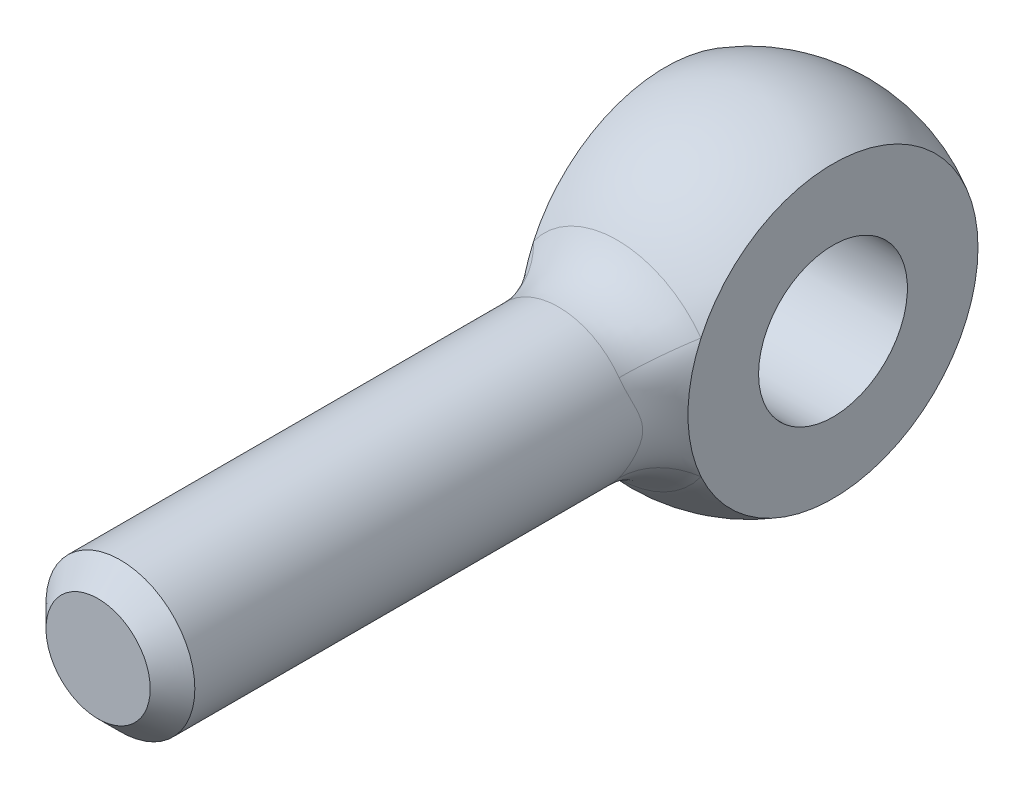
ISO-10303-21;
HEADER;
FILE_DESCRIPTION(('STEP AP214'),'2;1');
FILE_NAME('part.step','',(''),(''),'','','');
FILE_SCHEMA(('AUTOMOTIVE_DESIGN { 1 0 10303 214 1 1 1 1 }'));
ENDSEC;
DATA;
#1=APPLICATION_CONTEXT('core data for automotive mechanical design processes');
#2=APPLICATION_PROTOCOL_DEFINITION('international standard','automotive_design',2000,#1);
#3=PRODUCT_CONTEXT('',#1,'mechanical');
#4=PRODUCT('Part','Part','',(#3));
#5=PRODUCT_RELATED_PRODUCT_CATEGORY('part','',(#4));
#6=PRODUCT_DEFINITION_FORMATION('','',#4);
#7=PRODUCT_DEFINITION_CONTEXT('part definition',#1,'design');
#8=PRODUCT_DEFINITION('design','',#6,#7);
#9=PRODUCT_DEFINITION_SHAPE('','',#8);
#10=(LENGTH_UNIT() NAMED_UNIT(*) SI_UNIT(.MILLI.,.METRE.));
#11=(NAMED_UNIT(*) PLANE_ANGLE_UNIT() SI_UNIT($,.RADIAN.));
#12=(NAMED_UNIT(*) SI_UNIT($,.STERADIAN.) SOLID_ANGLE_UNIT());
#13=UNCERTAINTY_MEASURE_WITH_UNIT(LENGTH_MEASURE(1.E-05),#10,'distance_accuracy_value','');
#14=(GEOMETRIC_REPRESENTATION_CONTEXT(3) GLOBAL_UNCERTAINTY_ASSIGNED_CONTEXT((#13)) GLOBAL_UNIT_ASSIGNED_CONTEXT((#10,
#11,#12)) REPRESENTATION_CONTEXT('',''));
#15=CARTESIAN_POINT('',(0.,0.,0.));
#16=DIRECTION('',(0.,0.,1.));
#17=DIRECTION('',(1.,0.,0.));
#18=AXIS2_PLACEMENT_3D('',#15,#16,#17);
#19=CARTESIAN_POINT('',(0.,0.,0.));
#20=DIRECTION('',(-1.,0.,0.));
#21=DIRECTION('',(0.,0.,-1.));
#22=AXIS2_PLACEMENT_3D('',#19,#20,#21);
#23=SPHERICAL_SURFACE('',#22,9.);
#24=CARTESIAN_POINT('',(4.5,0.,0.));
#25=DIRECTION('',(1.,0.,0.));
#26=DIRECTION('',(0.,0.,1.));
#27=AXIS2_PLACEMENT_3D('',#24,#25,#26);
#28=CIRCLE('',#27,7.79422863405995);
#29=CARTESIAN_POINT('',(4.5,3.22870813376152,7.09404283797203));
#30=VERTEX_POINT('',#29);
#31=CARTESIAN_POINT('',(4.5,-3.22870813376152,7.09404283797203));
#32=VERTEX_POINT('',#31);
#33=EDGE_CURVE('E64',#30,#32,#28,.F.);
#34=ORIENTED_EDGE('',*,*,#33,.T.);
#35=CARTESIAN_POINT('',(0.,0.,7.09404283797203));
#36=DIRECTION('',(0.,0.,-1.));
#37=DIRECTION('',(-1.,0.,0.));
#38=AXIS2_PLACEMENT_3D('',#35,#36,#37);
#39=CIRCLE('',#38,5.53846153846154);
#40=CARTESIAN_POINT('',(-4.5,-3.22870813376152,7.09404283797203));
#41=VERTEX_POINT('',#40);
#42=EDGE_CURVE('E72',#32,#41,#39,.T.);
#43=ORIENTED_EDGE('',*,*,#42,.T.);
#44=CARTESIAN_POINT('',(-4.5,0.,0.));
#45=DIRECTION('',(1.,0.,0.));
#46=DIRECTION('',(0.,0.,1.));
#47=AXIS2_PLACEMENT_3D('',#44,#45,#46);
#48=CIRCLE('',#47,7.79422863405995);
#49=CARTESIAN_POINT('',(-4.5,3.22870813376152,7.09404283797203));
#50=VERTEX_POINT('',#49);
#51=EDGE_CURVE('E60',#50,#41,#48,.F.);
#52=ORIENTED_EDGE('',*,*,#51,.F.);
#53=CARTESIAN_POINT('',(0.,0.,7.09404283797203));
#54=DIRECTION('',(0.,0.,-1.));
#55=DIRECTION('',(-1.,0.,0.));
#56=AXIS2_PLACEMENT_3D('',#53,#54,#55);
#57=CIRCLE('',#56,5.53846153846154);
#58=EDGE_CURVE('E69',#50,#30,#57,.T.);
#59=ORIENTED_EDGE('',*,*,#58,.T.);
#60=EDGE_LOOP('',(#34,#43,#52,#59));
#61=FACE_BOUND('',#60,.T.);
#62=ADVANCED_FACE('F14',(#61),#23,.T.);
#63=CARTESIAN_POINT('',(0.,0.,-10.));
#64=DIRECTION('',(0.,0.,-1.));
#65=DIRECTION('',(1.,0.,0.));
#66=AXIS2_PLACEMENT_3D('',#63,#64,#65);
#67=CYLINDRICAL_SURFACE('',#66,4.);
#68=CARTESIAN_POINT('',(4.5,3.8544457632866,6.77445553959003));
#69=CARTESIAN_POINT('',(3.04270474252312,2.62315350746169,7.93032272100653));
#70=CARTESIAN_POINT('',(2.7741231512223,2.881707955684,10.1296027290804));
#71=CARTESIAN_POINT('',(4.5,3.8063552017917,6.8018140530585));
#72=CARTESIAN_POINT('',(3.05482576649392,2.60369447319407,7.96461619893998));
#73=CARTESIAN_POINT('',(2.81753121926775,2.83992613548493,10.1500330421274));
#74=CARTESIAN_POINT('',(4.5,3.75734620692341,6.82902432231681));
#75=CARTESIAN_POINT('',(3.06839168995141,2.5833163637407,7.99813664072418));
#76=CARTESIAN_POINT('',(2.86015231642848,2.79700081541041,10.1676065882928));
#77=CARTESIAN_POINT('',(4.5,3.65731222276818,6.88311775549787));
#78=CARTESIAN_POINT('',(3.09821295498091,2.54027572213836,8.06327876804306));
#79=CARTESIAN_POINT('',(2.94360667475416,2.70903056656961,10.1973192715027));
#80=CARTESIAN_POINT('',(4.5,3.60628811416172,6.91000105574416));
#81=CARTESIAN_POINT('',(3.11445034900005,2.51763114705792,8.09489992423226));
#82=CARTESIAN_POINT('',(2.98444070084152,2.66398656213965,10.2094607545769));
#83=CARTESIAN_POINT('',(4.5,3.45034294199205,6.98990310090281));
#84=CARTESIAN_POINT('',(3.16665597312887,2.44590984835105,8.18616546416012));
#85=CARTESIAN_POINT('',(3.10362883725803,2.5262969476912,10.2380896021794));
#86=CARTESIAN_POINT('',(4.5,3.34210856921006,7.04242695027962));
#87=CARTESIAN_POINT('',(3.20638316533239,2.39264902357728,8.24298064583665));
#88=CARTESIAN_POINT('',(3.17907335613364,2.43070509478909,10.2469645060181));
#89=CARTESIAN_POINT('',(4.5,3.07131788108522,7.16568134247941));
#90=CARTESIAN_POINT('',(3.30980222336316,2.24847718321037,8.36667989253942));
#91=CARTESIAN_POINT('',(3.3484402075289,2.19463495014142,10.2469316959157));
#92=CARTESIAN_POINT('',(4.5,2.90397618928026,7.23557083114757));
#93=CARTESIAN_POINT('',(3.37687085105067,2.15099293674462,8.42942404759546));
#94=CARTESIAN_POINT('',(3.4381775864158,2.05112903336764,10.2297903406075));
#95=CARTESIAN_POINT('',(4.5,2.63520895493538,7.33585873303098));
#96=CARTESIAN_POINT('',(3.48042901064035,1.97974794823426,8.50775356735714));
#97=CARTESIAN_POINT('',(3.55838650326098,1.82895031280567,10.1852430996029));
#98=CARTESIAN_POINT('',(4.5,2.54243406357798,7.36859815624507));
#99=CARTESIAN_POINT('',(3.51533532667,1.9187130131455,8.53118988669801));
#100=CARTESIAN_POINT('',(3.5961245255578,1.75356165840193,10.1671934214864));
#101=CARTESIAN_POINT('',(4.5,2.35049327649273,7.43205257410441));
#102=CARTESIAN_POINT('',(3.58449538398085,1.7884352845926,8.57274310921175));
#103=CARTESIAN_POINT('',(3.66666176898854,1.60082878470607,10.1262456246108));
#104=CARTESIAN_POINT('',(4.5,2.25132856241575,7.46276794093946));
#105=CARTESIAN_POINT('',(3.61876374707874,1.71923098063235,8.59090327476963));
#106=CARTESIAN_POINT('',(3.69946189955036,1.52348492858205,10.1033484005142));
#107=CARTESIAN_POINT('',(4.5,2.0304613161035,7.52611271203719));
#108=CARTESIAN_POINT('',(3.69027444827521,1.56151844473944,8.62452070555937));
#109=CARTESIAN_POINT('',(3.76469519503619,1.35514764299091,10.0506349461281));
#110=CARTESIAN_POINT('',(4.5,1.90763213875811,7.55831566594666));
#111=CARTESIAN_POINT('',(3.72725176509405,1.47161056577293,8.63921494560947));
#112=CARTESIAN_POINT('',(3.79630400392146,1.26387674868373,10.020296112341));
#113=CARTESIAN_POINT('',(4.5,1.65232180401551,7.61820329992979));
#114=CARTESIAN_POINT('',(3.79632113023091,1.28138713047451,8.66269061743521));
#115=CARTESIAN_POINT('',(3.85283376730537,1.07934568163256,9.95859137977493));
#116=CARTESIAN_POINT('',(4.5,1.51983775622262,7.64588661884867));
#117=CARTESIAN_POINT('',(3.82847639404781,1.18104454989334,8.67151974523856));
#118=CARTESIAN_POINT('',(3.87775270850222,0.986084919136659,9.92722517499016));
#119=CARTESIAN_POINT('',(4.5,1.24584793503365,7.69526663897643));
#120=CARTESIAN_POINT('',(3.88574227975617,0.971416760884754,8.68456342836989));
#121=CARTESIAN_POINT('',(3.92072690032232,0.798212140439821,9.86763071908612));
#122=CARTESIAN_POINT('',(4.5,1.1043877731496,7.71699102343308));
#123=CARTESIAN_POINT('',(3.91095703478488,0.862096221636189,8.68883167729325));
#124=CARTESIAN_POINT('',(3.93881404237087,0.703608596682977,9.83938833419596));
#125=CARTESIAN_POINT('',(4.5,0.812986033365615,7.75309875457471));
#126=CARTESIAN_POINT('',(3.95269307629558,0.635873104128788,8.69452000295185));
#127=CARTESIAN_POINT('',(3.96815692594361,0.51286586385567,9.79055451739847));
#128=CARTESIAN_POINT('',(4.5,0.663048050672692,7.76748518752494));
#129=CARTESIAN_POINT('',(3.96928412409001,0.518825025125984,8.69595666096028));
#130=CARTESIAN_POINT('',(3.97941553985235,0.416727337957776,9.76995986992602));
#131=CARTESIAN_POINT('',(4.5,0.365918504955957,7.78697722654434));
#132=CARTESIAN_POINT('',(3.99168629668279,0.286607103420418,8.69758027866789));
#133=CARTESIAN_POINT('',(3.99451236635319,0.22864233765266,9.74161988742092));
#134=CARTESIAN_POINT('',(4.5,0.219018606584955,7.79254362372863));
#135=CARTESIAN_POINT('',(3.99806921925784,0.171508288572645,8.69783425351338));
#136=CARTESIAN_POINT('',(3.99871971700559,0.13675110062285,9.73323857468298));
#137=CARTESIAN_POINT('',(4.5,-0.0755179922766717,7.79525312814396));
#138=CARTESIAN_POINT('',(4.00117364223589,-0.059112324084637,8.69798034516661));
#139=CARTESIAN_POINT('',(4.00077867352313,-0.0471659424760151,9.72918999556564));
#140=CARTESIAN_POINT('',(4.5,-0.223154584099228,7.79239744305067));
#141=CARTESIAN_POINT('',(3.99790203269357,-0.174838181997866,8.69787274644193));
#142=CARTESIAN_POINT('',(3.99863119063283,-0.139191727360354,9.73352090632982));
#143=CARTESIAN_POINT('',(4.5,-0.515398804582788,7.7785543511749));
#144=CARTESIAN_POINT('',(3.98201549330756,-0.403449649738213,8.69691703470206));
#145=CARTESIAN_POINT('',(3.98800822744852,-0.322967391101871,9.75391826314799));
#146=CARTESIAN_POINT('',(4.5,-0.659988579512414,7.76752813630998));
#147=CARTESIAN_POINT('',(3.9693285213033,-0.516511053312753,8.69606346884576));
#148=CARTESIAN_POINT('',(3.9795025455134,-0.414713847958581,9.77004071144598));
#149=CARTESIAN_POINT('',(4.5,-0.942285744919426,7.73836484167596));
#150=CARTESIAN_POINT('',(3.93569076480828,-0.736344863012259,8.69237263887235));
#151=CARTESIAN_POINT('',(3.95627218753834,-0.596957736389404,9.81071532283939));
#152=CARTESIAN_POINT('',(4.5,-1.07998941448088,7.7202239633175));
#153=CARTESIAN_POINT('',(3.9146841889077,-0.84326203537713,8.68952532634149));
#154=CARTESIAN_POINT('',(3.94154418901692,-0.687454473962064,9.83527198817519));
#155=CARTESIAN_POINT('',(4.5,-1.37588482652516,7.67359136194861));
#156=CARTESIAN_POINT('',(3.86060975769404,-1.07137602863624,8.67936367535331));
#157=CARTESIAN_POINT('',(3.90215083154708,-0.886344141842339,9.89450733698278));
#158=CARTESIAN_POINT('',(4.5,-1.53205619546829,7.64370888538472));
#159=CARTESIAN_POINT('',(3.8258455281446,-1.19066872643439,8.67118584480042));
#160=CARTESIAN_POINT('',(3.87602422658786,-0.994368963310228,9.93022639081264));
#161=CARTESIAN_POINT('',(4.5,-1.83152718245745,7.57753636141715));
#162=CARTESIAN_POINT('',(3.74933129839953,-1.41560295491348,8.64748820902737));
#163=CARTESIAN_POINT('',(3.81488436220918,-1.20788558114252,10.0015265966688));
#164=CARTESIAN_POINT('',(4.5,-1.97482610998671,7.54124597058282));
#165=CARTESIAN_POINT('',(3.70747741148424,-1.52130100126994,8.63189852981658));
#166=CARTESIAN_POINT('',(3.77987062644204,-1.31337724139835,10.0371077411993));
#167=CARTESIAN_POINT('',(4.5,-2.24871161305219,7.46414404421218));
#168=CARTESIAN_POINT('',(3.62012648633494,-1.71797347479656,8.59208691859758));
#169=CARTESIAN_POINT('',(3.70118920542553,-1.5210087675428,10.1029124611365));
#170=CARTESIAN_POINT('',(4.5,-2.37934961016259,7.42335237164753));
#171=CARTESIAN_POINT('',(3.57457235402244,-1.80898132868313,8.56781003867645));
#172=CARTESIAN_POINT('',(3.65755891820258,-1.62316096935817,10.1331581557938));
#173=CARTESIAN_POINT('',(4.5,-2.62960061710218,7.33843673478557));
#174=CARTESIAN_POINT('',(3.48292493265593,-1.97675657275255,8.51005890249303));
#175=CARTESIAN_POINT('',(3.56168882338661,-1.82393375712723,10.1845863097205));
#176=CARTESIAN_POINT('',(4.5,-2.74921736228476,7.29431390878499));
#177=CARTESIAN_POINT('',(3.43680579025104,-2.05343576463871,8.47648952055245));
#178=CARTESIAN_POINT('',(3.50945194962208,-1.92255553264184,10.2057718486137));
#179=CARTESIAN_POINT('',(4.5,-2.94999939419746,7.21498918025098));
#180=CARTESIAN_POINT('',(3.35849710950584,-2.17571119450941,8.4098829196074));
#181=CARTESIAN_POINT('',(3.41071958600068,-2.09141957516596,10.2322288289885));
#182=CARTESIAN_POINT('',(4.5,-3.03332698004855,7.18029900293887));
#183=CARTESIAN_POINT('',(3.32563979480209,-2.22433900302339,8.37868925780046));
#184=CARTESIAN_POINT('',(3.36602915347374,-2.16261785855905,10.2401482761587));
#185=CARTESIAN_POINT('',(4.5,-3.19484965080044,7.10990099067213));
#186=CARTESIAN_POINT('',(3.26272074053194,-2.31453556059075,8.31149265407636));
#187=CARTESIAN_POINT('',(3.27220326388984,-2.3021184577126,10.2480230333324));
#188=CARTESIAN_POINT('',(4.5,-3.27304643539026,7.07419349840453));
#189=CARTESIAN_POINT('',(3.23268360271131,-2.3560481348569,8.2754625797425));
#190=CARTESIAN_POINT('',(3.22306929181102,-2.3704217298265,10.2479809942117));
#191=CARTESIAN_POINT('',(4.5,-3.42565196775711,7.00158146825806));
#192=CARTESIAN_POINT('',(3.17620411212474,-2.43330706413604,8.19857609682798));
#193=CARTESIAN_POINT('',(3.12008076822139,-2.50445754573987,10.2388956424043));
#194=CARTESIAN_POINT('',(4.5,-3.50000806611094,6.96466797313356));
#195=CARTESIAN_POINT('',(3.1498466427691,-2.46892157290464,8.15765508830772));
#196=CARTESIAN_POINT('',(3.06617923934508,-2.5701524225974,10.2297508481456));
#197=CARTESIAN_POINT('',(4.5,-3.64453597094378,6.89013229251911));
#198=CARTESIAN_POINT('',(3.10187955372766,-2.53501235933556,8.07177995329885));
#199=CARTESIAN_POINT('',(2.95455075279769,-2.69775137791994,10.2014354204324));
#200=CARTESIAN_POINT('',(4.5,-3.71470335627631,6.85250941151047));
#201=CARTESIAN_POINT('',(3.08031937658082,-2.56543141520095,8.02681699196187));
#202=CARTESIAN_POINT('',(2.89681988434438,-2.75965145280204,10.1822543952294));
#203=CARTESIAN_POINT('',(4.5,-3.78298226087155,6.81461996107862));
#204=CARTESIAN_POINT('',(3.06161168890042,-2.59377871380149,7.98028977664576));
#205=CARTESIAN_POINT('',(2.83743688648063,-2.81938857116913,10.1576271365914));
#206=(BOUNDED_SURFACE() B_SPLINE_SURFACE(3,2,((#68,#69,#70),(#71,#72,#73),(#74,#75,#76),(#77,
#78,#79),(#80,#81,#82),(#83,#84,#85),(#86,#87,#88),(#89,#90,#91),(#92,#93,#94),(#95,#96,#97),
(#98,#99,#100),(#101,#102,#103),(#104,#105,#106),(#107,#108,#109),(#110,#111,#112),(#113,#114,
#115),(#116,#117,#118),(#119,#120,#121),(#122,#123,#124),(#125,#126,#127),(#128,#129,#130),
(#131,#132,#133),(#134,#135,#136),(#137,#138,#139),(#140,#141,#142),(#143,#144,#145),(#146,#147,
#148),(#149,#150,#151),(#152,#153,#154),(#155,#156,#157),(#158,#159,#160),(#161,#162,#163),
(#164,#165,#166),(#167,#168,#169),(#170,#171,#172),(#173,#174,#175),(#176,#177,#178),(#179,#180,
#181),(#182,#183,#184),(#185,#186,#187),(#188,#189,#190),(#191,#192,#193),(#194,#195,#196),
(#197,#198,#199),(#200,#201,#202),(#203,#204,#205)),.UNSPECIFIED.,.F.,.F.,
.F.) B_SPLINE_SURFACE_WITH_KNOTS((4,2,2,2,2,2,2,2,2,2,2,2,2,2,2,2,2,2,2,2,2,2,4),(3,3),(0.,
0.366533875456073,0.732909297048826,1.46227559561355,2.47457458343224,2.98299508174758,
3.49132182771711,4.07744171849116,4.66373780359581,5.24726215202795,5.8305408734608,
6.38220343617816,6.93378689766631,7.48800717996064,8.04252376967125,8.71711530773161,
9.39174301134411,10.0635045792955,10.7350376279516,11.239494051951,11.7437825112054,
12.2537566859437,12.7642599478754),(0.,1.),
.UNSPECIFIED.) GEOMETRIC_REPRESENTATION_ITEM() RATIONAL_B_SPLINE_SURFACE(((1.,0.873374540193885,
1.),(1.,0.875240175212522,1.),(1.,0.877181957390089,1.),(1.,0.881198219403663,1.),(1.,
0.883272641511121,1.),(1.,0.889648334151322,1.),(1.,0.894119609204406,1.),(1.,0.905097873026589,
1.),(1.,0.911721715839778,1.),(1.,0.921524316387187,1.),(1.,0.924776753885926,1.),(1.,
0.931143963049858,1.),(1.,0.934258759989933,1.),(1.,0.940716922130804,1.),(1.,0.944022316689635,
1.),(1.,0.950179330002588,1.),(1.,0.953030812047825,1.),(1.,0.958111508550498,1.),(1.,
0.96034360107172,1.),(1.,0.964046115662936,1.),(1.,0.965516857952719,1.),(1.,0.967507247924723,
1.),(1.,0.968074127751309,1.),(1.,0.96835024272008,1.),(1.,0.968059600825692,1.),(1.,
0.966647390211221,1.),(1.,0.96552185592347,1.),(1.,0.962536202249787,1.),(1.,0.960675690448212,
1.),(1.,0.955882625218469,1.),(1.,0.952805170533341,1.),(1.,0.945996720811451,1.),(1.,
0.942265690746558,1.),(1.,0.934394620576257,1.),(1.,0.930256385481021,1.),(1.,0.921773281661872,
1.),(1.,0.917428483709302,1.),(1.,0.909818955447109,1.),(1.,0.90655445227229,1.),(1.,
0.900106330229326,1.),(1.,0.896922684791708,1.),(1.,0.890676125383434,1.),(1.,0.887614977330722,
1.),(1.,0.881712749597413,1.),(1.,0.8788719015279,1.),(1.,0.876174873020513,1.))) REPRESENTATION_ITEM('') SURFACE());
#207=CARTESIAN_POINT('',(2.83743688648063,-2.81938857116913,10.1576271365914));
#208=CARTESIAN_POINT('',(2.89681988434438,-2.75965145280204,10.1822543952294));
#209=CARTESIAN_POINT('',(2.95455075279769,-2.69775137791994,10.2014354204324));
#210=CARTESIAN_POINT('',(3.06617923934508,-2.5701524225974,10.2297508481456));
#211=CARTESIAN_POINT('',(3.12008076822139,-2.50445754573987,10.2388956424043));
#212=CARTESIAN_POINT('',(3.22306929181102,-2.3704217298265,10.2479809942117));
#213=CARTESIAN_POINT('',(3.27220326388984,-2.3021184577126,10.2480230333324));
#214=CARTESIAN_POINT('',(3.36602915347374,-2.16261785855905,10.2401482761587));
#215=CARTESIAN_POINT('',(3.41071958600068,-2.09141957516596,10.2322288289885));
#216=CARTESIAN_POINT('',(3.50945194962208,-1.92255553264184,10.2057718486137));
#217=CARTESIAN_POINT('',(3.56168882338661,-1.82393375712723,10.1845863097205));
#218=CARTESIAN_POINT('',(3.65755891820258,-1.62316096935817,10.1331581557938));
#219=CARTESIAN_POINT('',(3.70118920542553,-1.5210087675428,10.1029124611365));
#220=CARTESIAN_POINT('',(3.77987062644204,-1.31337724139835,10.0371077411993));
#221=CARTESIAN_POINT('',(3.81488436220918,-1.20788558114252,10.0015265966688));
#222=CARTESIAN_POINT('',(3.87602422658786,-0.994368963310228,9.93022639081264));
#223=CARTESIAN_POINT('',(3.90215083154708,-0.886344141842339,9.89450733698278));
#224=CARTESIAN_POINT('',(3.94154418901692,-0.687454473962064,9.83527198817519));
#225=CARTESIAN_POINT('',(3.95627218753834,-0.596957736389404,9.81071532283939));
#226=CARTESIAN_POINT('',(3.9795025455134,-0.414713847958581,9.77004071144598));
#227=CARTESIAN_POINT('',(3.98800822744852,-0.322967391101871,9.75391826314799));
#228=CARTESIAN_POINT('',(3.99863119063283,-0.139191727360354,9.73352090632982));
#229=CARTESIAN_POINT('',(4.00077867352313,-0.0471659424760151,9.72918999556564));
#230=CARTESIAN_POINT('',(3.99871971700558,0.13675110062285,9.73323857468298));
#231=CARTESIAN_POINT('',(3.99451236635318,0.22864233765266,9.74161988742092));
#232=CARTESIAN_POINT('',(3.97941553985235,0.416727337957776,9.76995986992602));
#233=CARTESIAN_POINT('',(3.96815692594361,0.51286586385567,9.79055451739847));
#234=CARTESIAN_POINT('',(3.93881404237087,0.703608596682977,9.83938833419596));
#235=CARTESIAN_POINT('',(3.92072690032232,0.798212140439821,9.86763071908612));
#236=CARTESIAN_POINT('',(3.87775270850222,0.986084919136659,9.92722517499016));
#237=CARTESIAN_POINT('',(3.85283376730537,1.07934568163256,9.95859137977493));
#238=CARTESIAN_POINT('',(3.79630400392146,1.26387674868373,10.020296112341));
#239=CARTESIAN_POINT('',(3.76469519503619,1.35514764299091,10.0506349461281));
#240=CARTESIAN_POINT('',(3.69946189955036,1.52348492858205,10.1033484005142));
#241=CARTESIAN_POINT('',(3.66666176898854,1.60082878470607,10.1262456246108));
#242=CARTESIAN_POINT('',(3.5961245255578,1.75356165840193,10.1671934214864));
#243=CARTESIAN_POINT('',(3.55838650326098,1.82895031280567,10.1852430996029));
#244=CARTESIAN_POINT('',(3.4381775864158,2.05112903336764,10.2297903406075));
#245=CARTESIAN_POINT('',(3.3484402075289,2.19463495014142,10.2469316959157));
#246=CARTESIAN_POINT('',(3.17907335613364,2.43070509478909,10.2469645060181));
#247=CARTESIAN_POINT('',(3.10362883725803,2.5262969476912,10.2380896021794));
#248=CARTESIAN_POINT('',(2.98444070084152,2.66398656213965,10.2094607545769));
#249=CARTESIAN_POINT('',(2.94360667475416,2.70903056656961,10.1973192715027));
#250=CARTESIAN_POINT('',(2.86015231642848,2.79700081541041,10.1676065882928));
#251=CARTESIAN_POINT('',(2.81753121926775,2.83992613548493,10.1500330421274));
#252=CARTESIAN_POINT('',(2.7741231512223,2.881707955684,10.1296027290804));
#253=B_SPLINE_CURVE_WITH_KNOTS('',3,(#207,#208,#209,#210,#211,#212,#213,#214,#215,#216,#217,
#218,#219,#220,#221,#222,#223,#224,#225,#226,#227,#228,#229,#230,#231,#232,#233,#234,#235,#236,
#237,#238,#239,#240,#241,#242,#243,#244,#245,#246,#247,#248,#249,#250,#251,#252),.UNSPECIFIED.,
.F.,.F.,(4,2,2,2,2,2,2,2,2,2,2,2,2,2,2,2,2,2,2,2,2,2,4),(0.,0.510503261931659,1.02047743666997,
1.52476589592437,2.02922231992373,2.7007553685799,3.37251693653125,4.04714464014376,
4.72173617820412,5.27625276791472,5.83047305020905,6.3820565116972,6.93371907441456,
7.51699779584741,8.10052214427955,8.6868182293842,9.27293812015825,9.78126486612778,
10.2896853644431,11.3019843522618,12.0313506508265,12.3977260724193,12.7642599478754),.UNSPECIFIED.);
#254=CARTESIAN_POINT('',(3.25,-2.33184476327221,10.2469507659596));
#255=VERTEX_POINT('',#254);
#256=CARTESIAN_POINT('',(3.25,2.3318447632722,10.2469507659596));
#257=VERTEX_POINT('',#256);
#258=EDGE_CURVE('E87',#255,#257,#253,.T.);
#259=ORIENTED_EDGE('',*,*,#258,.T.);
#260=CARTESIAN_POINT('',(0.,0.,10.2469507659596));
#261=DIRECTION('',(0.,0.,-1.));
#262=DIRECTION('',(-1.,0.,0.));
#263=AXIS2_PLACEMENT_3D('',#260,#261,#262);
#264=CIRCLE('',#263,4.);
#265=CARTESIAN_POINT('',(-3.25,2.33184476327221,10.2469507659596));
#266=VERTEX_POINT('',#265);
#267=EDGE_CURVE('E9',#257,#266,#264,.F.);
#268=ORIENTED_EDGE('',*,*,#267,.T.);
#269=CARTESIAN_POINT('',(-4.5,-3.85444584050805,6.77445549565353));
#270=CARTESIAN_POINT('',(-3.04270471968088,-2.62315352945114,7.93032267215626));
#271=CARTESIAN_POINT('',(-2.7741231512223,-2.881707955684,10.1296027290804));
#272=CARTESIAN_POINT('',(-4.5,-3.80635523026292,6.80181403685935));
#273=CARTESIAN_POINT('',(-3.05482575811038,-2.60369448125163,7.9646161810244));
#274=CARTESIAN_POINT('',(-2.81753121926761,-2.83992613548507,10.1500330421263));
#275=CARTESIAN_POINT('',(-4.5,-3.75734621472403,6.82902431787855));
#276=CARTESIAN_POINT('',(-3.06839168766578,-2.58331636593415,7.99813663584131));
#277=CARTESIAN_POINT('',(-2.86015231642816,-2.79700081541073,10.1676065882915));
#278=CARTESIAN_POINT('',(-4.5,-3.65731221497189,6.8831177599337));
#279=CARTESIAN_POINT('',(-3.09821295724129,-2.54027571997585,8.06327877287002));
#280=CARTESIAN_POINT('',(-2.94360667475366,-2.70903056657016,10.1973192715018));
#281=CARTESIAN_POINT('',(-4.5,-3.60628811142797,6.91000105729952));
#282=CARTESIAN_POINT('',(-3.1144503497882,-2.51763114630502,8.09489992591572));
#283=CARTESIAN_POINT('',(-2.98444070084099,-2.66398656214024,10.2094607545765));
#284=CARTESIAN_POINT('',(-4.5,-3.45034294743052,6.98990309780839));
#285=CARTESIAN_POINT('',(-3.16665597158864,-2.44590984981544,8.18616546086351));
#286=CARTESIAN_POINT('',(-3.10362883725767,-2.52629694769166,10.2380896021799));
#287=CARTESIAN_POINT('',(-4.5,-3.34210857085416,7.04242694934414));
#288=CARTESIAN_POINT('',(-3.20638316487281,-2.39264902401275,8.24298064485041));
#289=CARTESIAN_POINT('',(-3.17907335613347,-2.43070509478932,10.2469645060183));
#290=CARTESIAN_POINT('',(-4.5,-3.07131787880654,7.16568134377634));
#291=CARTESIAN_POINT('',(-3.30980222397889,-2.2484771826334,8.36667989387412));
#292=CARTESIAN_POINT('',(-3.3484402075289,-2.19463495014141,10.2469316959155));
#293=CARTESIAN_POINT('',(-4.5,-2.9039761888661,7.2355708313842));
#294=CARTESIAN_POINT('',(-3.37687085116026,-2.15099293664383,8.42942404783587));
#295=CARTESIAN_POINT('',(-3.4381775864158,-2.05112903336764,10.2297903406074));
#296=CARTESIAN_POINT('',(-4.5,-2.63520895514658,7.33585873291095));
#297=CARTESIAN_POINT('',(-3.4804290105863,-1.97974794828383,8.50775356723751));
#298=CARTESIAN_POINT('',(-3.55838650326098,-1.82895031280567,10.1852430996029));
#299=CARTESIAN_POINT('',(-4.5,-2.54243406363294,7.36859815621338));
#300=CARTESIAN_POINT('',(-3.51533532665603,-1.91871301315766,8.53118988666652));
#301=CARTESIAN_POINT('',(-3.5961245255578,-1.75356165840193,10.1671934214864));
#302=CARTESIAN_POINT('',(-4.5,-2.35049327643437,7.43205257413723));
#303=CARTESIAN_POINT('',(-3.58449538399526,-1.78843528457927,8.57274310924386));
#304=CARTESIAN_POINT('',(-3.66666176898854,-1.60082878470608,10.1262456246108));
#305=CARTESIAN_POINT('',(-4.5,-2.25132856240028,7.4627679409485));
#306=CARTESIAN_POINT('',(-3.61876374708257,-1.71923098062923,8.59090327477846));
#307=CARTESIAN_POINT('',(-3.69946189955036,-1.52348492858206,10.1033484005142));
#308=CARTESIAN_POINT('',(-4.5,-2.0304613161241,7.52611271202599));
#309=CARTESIAN_POINT('',(-3.69027444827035,-1.56151844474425,8.62452070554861));
#310=CARTESIAN_POINT('',(-3.76469519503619,-1.35514764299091,10.0506349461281));
#311=CARTESIAN_POINT('',(-4.5,-1.90763213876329,7.55831566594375));
#312=CARTESIAN_POINT('',(-3.72725176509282,-1.471610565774,8.63921494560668));
#313=CARTESIAN_POINT('',(-3.79630400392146,-1.26387674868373,10.020296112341));
#314=CARTESIAN_POINT('',(-4.5,-1.65232180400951,7.6182032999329));
#315=CARTESIAN_POINT('',(-3.79632113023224,-1.28138713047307,8.66269061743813));
#316=CARTESIAN_POINT('',(-3.85283376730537,-1.07934568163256,9.95859137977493));
#317=CARTESIAN_POINT('',(-4.5,-1.51983775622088,7.6458866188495));
#318=CARTESIAN_POINT('',(-3.82847639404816,-1.18104454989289,8.67151974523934));
#319=CARTESIAN_POINT('',(-3.87775270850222,-0.986084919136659,9.92722517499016));
#320=CARTESIAN_POINT('',(-4.5,-1.24584793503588,7.69526663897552));
#321=CARTESIAN_POINT('',(-3.88574227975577,-0.971416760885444,8.68456342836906));
#322=CARTESIAN_POINT('',(-3.92072690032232,-0.798212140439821,9.86763071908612));
#323=CARTESIAN_POINT('',(-4.5,-1.10438777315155,7.71699102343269));
#324=CARTESIAN_POINT('',(-3.91095703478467,-0.862096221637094,8.68883167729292));
#325=CARTESIAN_POINT('',(-3.93881404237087,-0.703608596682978,9.83938833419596));
#326=CARTESIAN_POINT('',(-4.5,-0.812986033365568,7.75309875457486));
#327=CARTESIAN_POINT('',(-3.95269307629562,-0.635873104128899,8.69452000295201));
#328=CARTESIAN_POINT('',(-3.96815692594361,-0.512865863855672,9.79055451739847));
#329=CARTESIAN_POINT('',(-4.5,-0.663048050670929,7.7674851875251));
#330=CARTESIAN_POINT('',(-3.96928412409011,-0.518825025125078,8.69595666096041));
#331=CARTESIAN_POINT('',(-3.97941553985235,-0.416727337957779,9.76995986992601));
#332=CARTESIAN_POINT('',(-4.5,-0.365918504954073,7.78697722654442));
#333=CARTESIAN_POINT('',(-3.99168629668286,-0.286607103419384,8.69758027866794));
#334=CARTESIAN_POINT('',(-3.99451236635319,-0.228642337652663,9.74161988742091));
#335=CARTESIAN_POINT('',(-4.5,-0.219018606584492,7.79254362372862));
#336=CARTESIAN_POINT('',(-3.99806921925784,-0.171508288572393,8.69783425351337));
#337=CARTESIAN_POINT('',(-3.99871971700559,-0.136751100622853,9.73323857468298));
#338=CARTESIAN_POINT('',(-4.5,0.0755179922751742,7.79525312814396));
#339=CARTESIAN_POINT('',(-4.00117364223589,0.0591123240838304,8.69798034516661));
#340=CARTESIAN_POINT('',(-4.00077867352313,0.0471659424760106,9.72918999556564));
#341=CARTESIAN_POINT('',(-4.5,0.223154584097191,7.79239744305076));
#342=CARTESIAN_POINT('',(-3.99790203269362,0.174838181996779,8.69787274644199));
#343=CARTESIAN_POINT('',(-3.99863119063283,0.139191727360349,9.73352090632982));
#344=CARTESIAN_POINT('',(-4.5,0.515398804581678,7.77855435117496));
#345=CARTESIAN_POINT('',(-3.9820154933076,0.403449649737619,8.6969170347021));
#346=CARTESIAN_POINT('',(-3.98800822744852,0.322967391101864,9.75391826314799));
#347=CARTESIAN_POINT('',(-4.5,0.65998857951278,7.76752813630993));
#348=CARTESIAN_POINT('',(-3.96932852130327,0.516511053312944,8.69606346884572));
#349=CARTESIAN_POINT('',(-3.9795025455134,0.414713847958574,9.77004071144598));
#350=CARTESIAN_POINT('',(-4.5,0.94228574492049,7.73836484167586));
#351=CARTESIAN_POINT('',(-3.93569076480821,0.736344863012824,8.69237263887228));
#352=CARTESIAN_POINT('',(-3.95627218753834,0.596957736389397,9.81071532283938));
#353=CARTESIAN_POINT('',(-4.5,1.07998941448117,7.72022396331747));
#354=CARTESIAN_POINT('',(-3.91468418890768,0.843262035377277,8.68952532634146));
#355=CARTESIAN_POINT('',(-3.94154418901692,0.687454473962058,9.83527198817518));
#356=CARTESIAN_POINT('',(-4.5,1.37588482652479,7.67359136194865));
#357=CARTESIAN_POINT('',(-3.86060975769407,1.07137602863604,8.67936367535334));
#358=CARTESIAN_POINT('',(-3.90215083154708,0.886344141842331,9.89450733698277));
#359=CARTESIAN_POINT('',(-4.5,1.53205619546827,7.64370888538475));
#360=CARTESIAN_POINT('',(-3.82584552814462,1.1906687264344,8.67118584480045));
#361=CARTESIAN_POINT('',(-3.87602422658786,0.994368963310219,9.93022639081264));
#362=CARTESIAN_POINT('',(-4.5,1.83152718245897,7.57753636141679));
#363=CARTESIAN_POINT('',(-3.74933129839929,1.41560295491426,8.64748820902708));
#364=CARTESIAN_POINT('',(-3.81488436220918,1.20788558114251,10.0015265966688));
#365=CARTESIAN_POINT('',(-4.5,1.97482610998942,7.54124597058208));
#366=CARTESIAN_POINT('',(-3.70747741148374,1.52130100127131,8.63189852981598));
#367=CARTESIAN_POINT('',(-3.77987062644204,1.31337724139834,10.0371077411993));
#368=CARTESIAN_POINT('',(-4.5,2.24871161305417,7.4641440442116));
#369=CARTESIAN_POINT('',(-3.62012648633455,1.71797347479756,8.59208691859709));
#370=CARTESIAN_POINT('',(-3.70118920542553,1.52100876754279,10.1029124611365));
#371=CARTESIAN_POINT('',(-4.5,2.37934961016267,7.42335237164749));
#372=CARTESIAN_POINT('',(-3.57457235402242,1.80898132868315,8.56781003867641));
#373=CARTESIAN_POINT('',(-3.65755891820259,1.62316096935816,10.1331581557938));
#374=CARTESIAN_POINT('',(-4.5,2.62960061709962,7.33843673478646));
#375=CARTESIAN_POINT('',(-3.48292493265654,1.97675657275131,8.51005890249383));
#376=CARTESIAN_POINT('',(-3.56168882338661,1.82393375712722,10.1845863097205));
#377=CARTESIAN_POINT('',(-4.5,2.74921736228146,7.29431390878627));
#378=CARTESIAN_POINT('',(-3.4368057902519,2.05343576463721,8.47648952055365));
#379=CARTESIAN_POINT('',(-3.50945194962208,1.92255553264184,10.2057718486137));
#380=CARTESIAN_POINT('',(-4.5,2.94999939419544,7.2149891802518));
#381=CARTESIAN_POINT('',(-3.35849710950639,2.1757111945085,8.40988291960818));
#382=CARTESIAN_POINT('',(-3.41071958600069,2.09141957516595,10.2322288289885));
#383=CARTESIAN_POINT('',(-4.5,3.03332698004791,7.18029900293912));
#384=CARTESIAN_POINT('',(-3.32563979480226,2.22433900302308,8.37868925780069));
#385=CARTESIAN_POINT('',(-3.36602915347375,2.16261785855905,10.2401482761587));
#386=CARTESIAN_POINT('',(-4.5,3.19484965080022,7.10990099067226));
#387=CARTESIAN_POINT('',(-3.26272074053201,2.31453556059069,8.3114926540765));
#388=CARTESIAN_POINT('',(-3.27220326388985,2.30211845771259,10.2480230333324));
#389=CARTESIAN_POINT('',(-4.5,3.27304643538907,7.07419349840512));
#390=CARTESIAN_POINT('',(-3.23268360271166,2.35604813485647,8.2754625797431));
#391=CARTESIAN_POINT('',(-3.22306929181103,2.37042172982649,10.2479809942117));
#392=CARTESIAN_POINT('',(-4.5,3.42565196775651,7.00158146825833));
#393=CARTESIAN_POINT('',(-3.17620411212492,2.43330706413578,8.19857609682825));
#394=CARTESIAN_POINT('',(-3.1200807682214,2.50445754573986,10.2388956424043));
#395=CARTESIAN_POINT('',(-4.5,3.50000806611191,6.96466797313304));
#396=CARTESIAN_POINT('',(-3.14984664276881,2.46892157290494,8.15765508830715));
#397=CARTESIAN_POINT('',(-3.06617923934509,2.57015242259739,10.2297508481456));
#398=CARTESIAN_POINT('',(-4.5,3.64453597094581,6.8901322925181));
#399=CARTESIAN_POINT('',(-3.10187955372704,2.53501235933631,8.07177995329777));
#400=CARTESIAN_POINT('',(-2.9545507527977,2.69775137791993,10.2014354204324));
#401=CARTESIAN_POINT('',(-4.5,3.71470335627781,6.85250941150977));
#402=CARTESIAN_POINT('',(-3.08031937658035,2.56543141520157,8.02681699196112));
#403=CARTESIAN_POINT('',(-2.89681988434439,2.75965145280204,10.1822543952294));
#404=CARTESIAN_POINT('',(-4.5,3.78298226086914,6.81461996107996));
#405=CARTESIAN_POINT('',(-3.06161168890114,2.59377871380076,7.98028977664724));
#406=CARTESIAN_POINT('',(-2.83743688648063,2.81938857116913,10.1576271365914));
#407=(BOUNDED_SURFACE() B_SPLINE_SURFACE(3,2,((#269,#270,#271),(#272,#273,#274),(#275,#276,
#277),(#278,#279,#280),(#281,#282,#283),(#284,#285,#286),(#287,#288,#289),(#290,#291,#292),
(#293,#294,#295),(#296,#297,#298),(#299,#300,#301),(#302,#303,#304),(#305,#306,#307),(#308,#309,
#310),(#311,#312,#313),(#314,#315,#316),(#317,#318,#319),(#320,#321,#322),(#323,#324,#325),
(#326,#327,#328),(#329,#330,#331),(#332,#333,#334),(#335,#336,#337),(#338,#339,#340),(#341,#342,
#343),(#344,#345,#346),(#347,#348,#349),(#350,#351,#352),(#353,#354,#355),(#356,#357,#358),
(#359,#360,#361),(#362,#363,#364),(#365,#366,#367),(#368,#369,#370),(#371,#372,#373),(#374,#375,
#376),(#377,#378,#379),(#380,#381,#382),(#383,#384,#385),(#386,#387,#388),(#389,#390,#391),
(#392,#393,#394),(#395,#396,#397),(#398,#399,#400),(#401,#402,#403),(#404,#405,#406)),
.UNSPECIFIED.,.F.,.F.,.F.) B_SPLINE_SURFACE_WITH_KNOTS((4,2,2,2,2,2,2,2,2,2,2,2,2,2,2,2,2,2,2,2,
2,2,4),(3,3),(0.,0.366533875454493,0.732909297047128,1.46227559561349,2.47457458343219,
2.98299508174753,3.49132182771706,4.07744171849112,4.66373780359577,5.24726215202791,
5.83054087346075,6.38220343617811,6.93378689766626,7.48800717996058,8.04252376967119,
8.71711530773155,9.39174301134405,10.0635045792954,10.7350376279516,11.2394940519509,
11.7437825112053,12.2537566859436,12.7642599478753),(0.,1.),
.UNSPECIFIED.) GEOMETRIC_REPRESENTATION_ITEM() RATIONAL_B_SPLINE_SURFACE(((1.,0.873374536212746,
1.),(1.,0.875240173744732,1.),(1.,0.877181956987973,1.),(1.,0.881198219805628,1.),(1.,
0.883272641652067,1.),(1.,0.889648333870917,1.),(1.,0.894119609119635,1.),(1.,0.905097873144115,
1.),(1.,0.911721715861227,1.),(1.,0.921524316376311,1.),(1.,0.92477675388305,1.),(1.,
0.93114396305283,1.),(1.,0.934258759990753,1.),(1.,0.940716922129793,1.),(1.,0.944022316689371,
1.),(1.,0.950179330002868,1.),(1.,0.9530308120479,1.),(1.,0.958111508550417,1.),(1.,
0.960343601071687,1.),(1.,0.96404611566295,1.),(1.,0.965516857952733,1.),(1.,0.967507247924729,
1.),(1.,0.968074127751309,1.),(1.,0.968350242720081,1.),(1.,0.968059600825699,1.),(1.,
0.966647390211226,1.),(1.,0.965521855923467,1.),(1.,0.96253620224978,1.),(1.,0.96067569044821,
1.),(1.,0.955882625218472,1.),(1.,0.952805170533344,1.),(1.,0.945996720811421,1.),(1.,
0.942265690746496,1.),(1.,0.934394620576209,1.),(1.,0.930256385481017,1.),(1.,0.921773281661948,
1.),(1.,0.917428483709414,1.),(1.,0.909818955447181,1.),(1.,0.906554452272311,1.),(1.,
0.900106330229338,1.),(1.,0.896922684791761,1.),(1.,0.890676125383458,1.),(1.,0.887614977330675,
1.),(1.,0.881712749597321,1.),(1.,0.878871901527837,1.),(1.,0.876174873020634,1.))) REPRESENTATION_ITEM('') SURFACE());
#408=CARTESIAN_POINT('',(-2.83743688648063,2.81938857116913,10.1576271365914));
#409=CARTESIAN_POINT('',(-2.89681988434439,2.75965145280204,10.1822543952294));
#410=CARTESIAN_POINT('',(-2.9545507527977,2.69775137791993,10.2014354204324));
#411=CARTESIAN_POINT('',(-3.06617923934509,2.57015242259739,10.2297508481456));
#412=CARTESIAN_POINT('',(-3.1200807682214,2.50445754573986,10.2388956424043));
#413=CARTESIAN_POINT('',(-3.22306929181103,2.37042172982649,10.2479809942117));
#414=CARTESIAN_POINT('',(-3.27220326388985,2.30211845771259,10.2480230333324));
#415=CARTESIAN_POINT('',(-3.36602915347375,2.16261785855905,10.2401482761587));
#416=CARTESIAN_POINT('',(-3.41071958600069,2.09141957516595,10.2322288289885));
#417=CARTESIAN_POINT('',(-3.50945194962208,1.92255553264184,10.2057718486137));
#418=CARTESIAN_POINT('',(-3.56168882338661,1.82393375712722,10.1845863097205));
#419=CARTESIAN_POINT('',(-3.65755891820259,1.62316096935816,10.1331581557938));
#420=CARTESIAN_POINT('',(-3.70118920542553,1.52100876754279,10.1029124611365));
#421=CARTESIAN_POINT('',(-3.77987062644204,1.31337724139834,10.0371077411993));
#422=CARTESIAN_POINT('',(-3.81488436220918,1.20788558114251,10.0015265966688));
#423=CARTESIAN_POINT('',(-3.87602422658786,0.994368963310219,9.93022639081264));
#424=CARTESIAN_POINT('',(-3.90215083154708,0.886344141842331,9.89450733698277));
#425=CARTESIAN_POINT('',(-3.94154418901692,0.687454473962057,9.83527198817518));
#426=CARTESIAN_POINT('',(-3.95627218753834,0.596957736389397,9.81071532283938));
#427=CARTESIAN_POINT('',(-3.9795025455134,0.414713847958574,9.77004071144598));
#428=CARTESIAN_POINT('',(-3.98800822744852,0.322967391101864,9.75391826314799));
#429=CARTESIAN_POINT('',(-3.99863119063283,0.139191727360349,9.73352090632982));
#430=CARTESIAN_POINT('',(-4.00077867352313,0.0471659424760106,9.72918999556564));
#431=CARTESIAN_POINT('',(-3.99871971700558,-0.136751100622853,9.73323857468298));
#432=CARTESIAN_POINT('',(-3.99451236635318,-0.228642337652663,9.74161988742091));
#433=CARTESIAN_POINT('',(-3.97941553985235,-0.416727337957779,9.76995986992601));
#434=CARTESIAN_POINT('',(-3.96815692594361,-0.512865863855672,9.79055451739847));
#435=CARTESIAN_POINT('',(-3.93881404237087,-0.703608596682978,9.83938833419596));
#436=CARTESIAN_POINT('',(-3.92072690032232,-0.798212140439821,9.86763071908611));
#437=CARTESIAN_POINT('',(-3.87775270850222,-0.986084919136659,9.92722517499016));
#438=CARTESIAN_POINT('',(-3.85283376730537,-1.07934568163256,9.95859137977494));
#439=CARTESIAN_POINT('',(-3.79630400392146,-1.26387674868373,10.020296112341));
#440=CARTESIAN_POINT('',(-3.76469519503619,-1.35514764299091,10.0506349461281));
#441=CARTESIAN_POINT('',(-3.69946189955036,-1.52348492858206,10.1033484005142));
#442=CARTESIAN_POINT('',(-3.66666176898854,-1.60082878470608,10.1262456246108));
#443=CARTESIAN_POINT('',(-3.5961245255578,-1.75356165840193,10.1671934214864));
#444=CARTESIAN_POINT('',(-3.55838650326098,-1.82895031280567,10.1852430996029));
#445=CARTESIAN_POINT('',(-3.4381775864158,-2.05112903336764,10.2297903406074));
#446=CARTESIAN_POINT('',(-3.3484402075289,-2.19463495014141,10.2469316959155));
#447=CARTESIAN_POINT('',(-3.17907335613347,-2.43070509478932,10.2469645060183));
#448=CARTESIAN_POINT('',(-3.10362883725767,-2.52629694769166,10.2380896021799));
#449=CARTESIAN_POINT('',(-2.98444070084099,-2.66398656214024,10.2094607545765));
#450=CARTESIAN_POINT('',(-2.94360667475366,-2.70903056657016,10.1973192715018));
#451=CARTESIAN_POINT('',(-2.86015231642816,-2.79700081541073,10.1676065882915));
#452=CARTESIAN_POINT('',(-2.81753121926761,-2.83992613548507,10.1500330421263));
#453=CARTESIAN_POINT('',(-2.7741231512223,-2.881707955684,10.1296027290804));
#454=B_SPLINE_CURVE_WITH_KNOTS('',3,(#408,#409,#410,#411,#412,#413,#414,#415,#416,#417,#418,
#419,#420,#421,#422,#423,#424,#425,#426,#427,#428,#429,#430,#431,#432,#433,#434,#435,#436,#437,
#438,#439,#440,#441,#442,#443,#444,#445,#446,#447,#448,#449,#450,#451,#452,#453),.UNSPECIFIED.,
.F.,.F.,(4,2,2,2,2,2,2,2,2,2,2,2,2,2,2,2,2,2,2,2,2,2,4),(0.,0.510503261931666,1.02047743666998,
1.52476589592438,2.02922231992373,2.7007553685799,3.37251693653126,4.04714464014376,
4.72173617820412,5.27625276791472,5.83047305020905,6.38205651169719,6.93371907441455,
7.5169977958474,8.10052214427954,8.68681822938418,9.27293812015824,9.78126486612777,
10.2896853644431,11.3019843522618,12.0313506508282,12.3977260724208,12.7642599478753),.UNSPECIFIED.);
#455=CARTESIAN_POINT('',(-3.25,-2.33184476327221,10.2469507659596));
#456=VERTEX_POINT('',#455);
#457=EDGE_CURVE('E27',#266,#456,#454,.T.);
#458=ORIENTED_EDGE('',*,*,#457,.T.);
#459=CARTESIAN_POINT('',(0.,0.,10.2469507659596));
#460=DIRECTION('',(0.,0.,-1.));
#461=DIRECTION('',(-1.,0.,0.));
#462=AXIS2_PLACEMENT_3D('',#459,#460,#461);
#463=CIRCLE('',#462,4.);
#464=EDGE_CURVE('E101',#456,#255,#463,.F.);
#465=ORIENTED_EDGE('',*,*,#464,.T.);
#466=EDGE_LOOP('',(#259,#268,#458,#465));
#467=FACE_BOUND('',#466,.T.);
#468=CARTESIAN_POINT('',(0.,0.,33.8));
#469=DIRECTION('',(0.,0.,-1.));
#470=DIRECTION('',(1.,0.,0.));
#471=AXIS2_PLACEMENT_3D('',#468,#469,#470);
#472=CIRCLE('',#471,4.);
#473=CARTESIAN_POINT('',(4.,0.,33.8));
#474=VERTEX_POINT('',#473);
#475=EDGE_CURVE('E85',#474,#474,#472,.T.);
#476=ORIENTED_EDGE('',*,*,#475,.T.);
#477=EDGE_LOOP('',(#476));
#478=FACE_BOUND('',#477,.T.);
#479=ADVANCED_FACE('F107',(#467,#478),#67,.T.);
#480=CARTESIAN_POINT('',(0.,0.,35.));
#481=DIRECTION('',(0.,0.,-1.));
#482=DIRECTION('',(1.,0.,0.));
#483=AXIS2_PLACEMENT_3D('',#480,#481,#482);
#484=CONICAL_SURFACE('',#483,2.8,0.785398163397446);
#485=ORIENTED_EDGE('',*,*,#475,.F.);
#486=EDGE_LOOP('',(#485));
#487=FACE_BOUND('',#486,.T.);
#488=CARTESIAN_POINT('',(0.,0.,35.));
#489=DIRECTION('',(0.,0.,-1.));
#490=DIRECTION('',(1.,0.,0.));
#491=AXIS2_PLACEMENT_3D('',#488,#489,#490);
#492=CIRCLE('',#491,2.8);
#493=CARTESIAN_POINT('',(2.8,0.,35.));
#494=VERTEX_POINT('',#493);
#495=EDGE_CURVE('E73',#494,#494,#492,.T.);
#496=ORIENTED_EDGE('',*,*,#495,.T.);
#497=EDGE_LOOP('',(#496));
#498=FACE_BOUND('',#497,.T.);
#499=ADVANCED_FACE('F111',(#487,#498),#484,.T.);
#500=CARTESIAN_POINT('',(0.,-2.8,35.));
#501=DIRECTION('',(0.,0.,1.));
#502=DIRECTION('',(-1.,0.,0.));
#503=AXIS2_PLACEMENT_3D('',#500,#501,#502);
#504=PLANE('',#503);
#505=ORIENTED_EDGE('',*,*,#495,.F.);
#506=EDGE_LOOP('',(#505));
#507=FACE_BOUND('',#506,.T.);
#508=ADVANCED_FACE('F158',(#507),#504,.T.);
#509=CARTESIAN_POINT('',(-4.5,15.,-10.));
#510=DIRECTION('',(1.,0.,0.));
#511=DIRECTION('',(0.,0.,1.));
#512=AXIS2_PLACEMENT_3D('',#509,#510,#511);
#513=PLANE('',#512);
#514=CARTESIAN_POINT('',(-4.5,0.,0.));
#515=DIRECTION('',(1.,0.,0.));
#516=DIRECTION('',(0.,0.,1.));
#517=AXIS2_PLACEMENT_3D('',#514,#515,#516);
#518=CIRCLE('',#517,4.);
#519=CARTESIAN_POINT('',(-4.5,0.,4.));
#520=VERTEX_POINT('',#519);
#521=EDGE_CURVE('E253',#520,#520,#518,.T.);
#522=ORIENTED_EDGE('',*,*,#521,.T.);
#523=EDGE_LOOP('',(#522));
#524=FACE_BOUND('',#523,.T.);
#525=ORIENTED_EDGE('',*,*,#51,.T.);
#526=EDGE_CURVE('E57',#41,#50,#48,.F.);
#527=ORIENTED_EDGE('',*,*,#526,.T.);
#528=EDGE_LOOP('',(#525,#527));
#529=FACE_BOUND('',#528,.T.);
#530=ADVANCED_FACE('F59',(#524,#529),#513,.F.);
#531=CARTESIAN_POINT('',(4.5,15.,-10.));
#532=DIRECTION('',(1.,0.,0.));
#533=DIRECTION('',(0.,0.,1.));
#534=AXIS2_PLACEMENT_3D('',#531,#532,#533);
#535=PLANE('',#534);
#536=CARTESIAN_POINT('',(4.5,0.,0.));
#537=DIRECTION('',(1.,0.,0.));
#538=DIRECTION('',(0.,0.,1.));
#539=AXIS2_PLACEMENT_3D('',#536,#537,#538);
#540=CIRCLE('',#539,4.);
#541=CARTESIAN_POINT('',(4.5,0.,4.));
#542=VERTEX_POINT('',#541);
#543=EDGE_CURVE('E78',#542,#542,#540,.T.);
#544=ORIENTED_EDGE('',*,*,#543,.F.);
#545=EDGE_LOOP('',(#544));
#546=FACE_BOUND('',#545,.T.);
#547=ORIENTED_EDGE('',*,*,#33,.F.);
#548=EDGE_CURVE('E249',#32,#30,#28,.F.);
#549=ORIENTED_EDGE('',*,*,#548,.F.);
#550=EDGE_LOOP('',(#547,#549));
#551=FACE_BOUND('',#550,.T.);
#552=ADVANCED_FACE('F151',(#546,#551),#535,.T.);
#553=CARTESIAN_POINT('',(10.,0.,0.));
#554=DIRECTION('',(-1.,0.,0.));
#555=DIRECTION('',(0.,0.,-1.));
#556=AXIS2_PLACEMENT_3D('',#553,#554,#555);
#557=CYLINDRICAL_SURFACE('',#556,4.);
#558=ORIENTED_EDGE('',*,*,#543,.T.);
#559=EDGE_LOOP('',(#558));
#560=FACE_BOUND('',#559,.T.);
#561=ORIENTED_EDGE('',*,*,#521,.F.);
#562=EDGE_LOOP('',(#561));
#563=FACE_BOUND('',#562,.T.);
#564=ADVANCED_FACE('F126',(#560,#563),#557,.F.);
#565=CARTESIAN_POINT('',(-6.5,-4.66368952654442,10.2469507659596));
#566=DIRECTION('',(0.582961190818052,-0.8125,0.));
#567=DIRECTION('',(0.8125,0.582961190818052,0.));
#568=AXIS2_PLACEMENT_3D('',#565,#566,#567);
#569=CIRCLE('',#568,4.);
#570=EDGE_CURVE('E79',#456,#41,#569,.F.);
#571=ORIENTED_EDGE('',*,*,#570,.F.);
#572=ORIENTED_EDGE('',*,*,#457,.F.);
#573=CARTESIAN_POINT('',(-6.5,4.66368952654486,10.2469507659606));
#574=DIRECTION('',(-0.582961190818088,-0.812499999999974,0.));
#575=DIRECTION('',(0.812499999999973,-0.582961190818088,0.));
#576=AXIS2_PLACEMENT_3D('',#573,#574,#575);
#577=CIRCLE('',#576,4.);
#578=EDGE_CURVE('E75',#50,#266,#577,.T.);
#579=ORIENTED_EDGE('',*,*,#578,.F.);
#580=ORIENTED_EDGE('',*,*,#526,.F.);
#581=EDGE_LOOP('',(#571,#572,#579,#580));
#582=FACE_BOUND('',#581,.T.);
#583=ADVANCED_FACE('F76',(#582),#407,.F.);
#584=CARTESIAN_POINT('',(0.,0.,10.2469507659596));
#585=DIRECTION('',(0.,0.,-1.));
#586=DIRECTION('',(-1.,0.,0.));
#587=AXIS2_PLACEMENT_3D('',#584,#585,#586);
#588=TOROIDAL_SURFACE('',#587,8.,4.);
#589=ORIENTED_EDGE('',*,*,#578,.T.);
#590=ORIENTED_EDGE('',*,*,#267,.F.);
#591=CARTESIAN_POINT('',(6.5,4.66368952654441,10.2469507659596));
#592=DIRECTION('',(-0.582961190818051,0.8125,0.));
#593=DIRECTION('',(-0.8125,-0.582961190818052,0.));
#594=AXIS2_PLACEMENT_3D('',#591,#592,#593);
#595=CIRCLE('',#594,4.);
#596=EDGE_CURVE('E83',#30,#257,#595,.T.);
#597=ORIENTED_EDGE('',*,*,#596,.F.);
#598=ORIENTED_EDGE('',*,*,#58,.F.);
#599=EDGE_LOOP('',(#589,#590,#597,#598));
#600=FACE_BOUND('',#599,.T.);
#601=ADVANCED_FACE('F82',(#600),#588,.F.);
#602=CARTESIAN_POINT('',(0.,0.,10.2469507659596));
#603=DIRECTION('',(0.,0.,-1.));
#604=DIRECTION('',(-1.,0.,0.));
#605=AXIS2_PLACEMENT_3D('',#602,#603,#604);
#606=TOROIDAL_SURFACE('',#605,8.,4.);
#607=ORIENTED_EDGE('',*,*,#570,.T.);
#608=ORIENTED_EDGE('',*,*,#42,.F.);
#609=CARTESIAN_POINT('',(6.5,-4.66368952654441,10.2469507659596));
#610=DIRECTION('',(-0.582961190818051,-0.8125,0.));
#611=DIRECTION('',(0.8125,-0.582961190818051,0.));
#612=AXIS2_PLACEMENT_3D('',#609,#610,#611);
#613=CIRCLE('',#612,4.);
#614=EDGE_CURVE('E136',#255,#32,#613,.T.);
#615=ORIENTED_EDGE('',*,*,#614,.F.);
#616=ORIENTED_EDGE('',*,*,#464,.F.);
#617=EDGE_LOOP('',(#607,#608,#615,#616));
#618=FACE_BOUND('',#617,.T.);
#619=ADVANCED_FACE('F226',(#618),#606,.F.);
#620=ORIENTED_EDGE('',*,*,#596,.T.);
#621=ORIENTED_EDGE('',*,*,#258,.F.);
#622=ORIENTED_EDGE('',*,*,#614,.T.);
#623=ORIENTED_EDGE('',*,*,#548,.T.);
#624=EDGE_LOOP('',(#620,#621,#622,#623));
#625=FACE_BOUND('',#624,.T.);
#626=ADVANCED_FACE('F116',(#625),#206,.F.);
#627=CLOSED_SHELL('',(#62,#479,#499,#508,#530,#552,#564,#583,#601,#619,#626));
#628=MANIFOLD_SOLID_BREP('B1',#627);
#629=ADVANCED_BREP_SHAPE_REPRESENTATION('',(#18,#628),#14);
#630=SHAPE_DEFINITION_REPRESENTATION(#9,#629);
ENDSEC;
END-ISO-10303-21;
